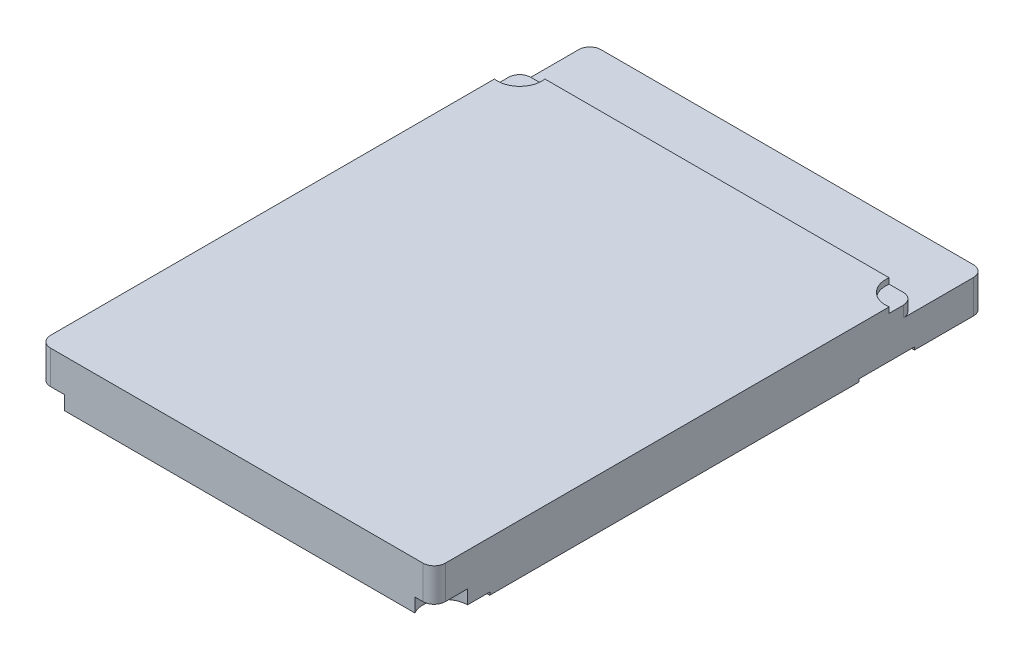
ISO-10303-21;
HEADER;
FILE_DESCRIPTION(('STEP AP214'),'2;1');
FILE_NAME('part.step','',(''),(''),'','','');
FILE_SCHEMA(('AUTOMOTIVE_DESIGN { 1 0 10303 214 1 1 1 1 }'));
ENDSEC;
DATA;
#1=APPLICATION_CONTEXT('core data for automotive mechanical design processes');
#2=APPLICATION_PROTOCOL_DEFINITION('international standard','automotive_design',2000,#1);
#3=PRODUCT_CONTEXT('',#1,'mechanical');
#4=PRODUCT('Part','Part','',(#3));
#5=PRODUCT_RELATED_PRODUCT_CATEGORY('part','',(#4));
#6=PRODUCT_DEFINITION_FORMATION('','',#4);
#7=PRODUCT_DEFINITION_CONTEXT('part definition',#1,'design');
#8=PRODUCT_DEFINITION('design','',#6,#7);
#9=PRODUCT_DEFINITION_SHAPE('','',#8);
#10=(LENGTH_UNIT() NAMED_UNIT(*) SI_UNIT(.MILLI.,.METRE.));
#11=(NAMED_UNIT(*) PLANE_ANGLE_UNIT() SI_UNIT($,.RADIAN.));
#12=(NAMED_UNIT(*) SI_UNIT($,.STERADIAN.) SOLID_ANGLE_UNIT());
#13=UNCERTAINTY_MEASURE_WITH_UNIT(LENGTH_MEASURE(1.E-05),#10,'distance_accuracy_value','');
#14=(GEOMETRIC_REPRESENTATION_CONTEXT(3) GLOBAL_UNCERTAINTY_ASSIGNED_CONTEXT((#13)) GLOBAL_UNIT_ASSIGNED_CONTEXT((#10,
#11,#12)) REPRESENTATION_CONTEXT('',''));
#15=CARTESIAN_POINT('',(0.,0.,0.));
#16=DIRECTION('',(0.,0.,1.));
#17=DIRECTION('',(1.,0.,0.));
#18=AXIS2_PLACEMENT_3D('',#15,#16,#17);
#19=CARTESIAN_POINT('',(19.2099650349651,-16.6076923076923,99.));
#20=DIRECTION('',(0.,1.,0.));
#21=DIRECTION('',(0.,0.,1.));
#22=AXIS2_PLACEMENT_3D('',#19,#20,#21);
#23=PLANE('',#22);
#24=DIRECTION('',(0.,0.,-1.));
#25=VECTOR('',#24,1.);
#26=CARTESIAN_POINT('',(90.2099650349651,-16.6076923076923,99.));
#27=LINE('',#26,#25);
#28=CARTESIAN_POINT('',(90.2099650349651,-16.6076923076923,12.6188488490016));
#29=VERTEX_POINT('',#28);
#30=CARTESIAN_POINT('',(90.2099650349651,-16.6076923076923,2.));
#31=VERTEX_POINT('',#30);
#32=EDGE_CURVE('E325',#29,#31,#27,.T.);
#33=ORIENTED_EDGE('',*,*,#32,.F.);
#34=DIRECTION('',(-1.,0.,0.));
#35=VECTOR('',#34,1.);
#36=CARTESIAN_POINT('',(19.2099650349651,-16.6076923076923,12.6188488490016));
#37=LINE('',#36,#35);
#38=CARTESIAN_POINT('',(19.2099650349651,-16.6076923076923,12.6188488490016));
#39=VERTEX_POINT('',#38);
#40=EDGE_CURVE('E251',#29,#39,#37,.T.);
#41=ORIENTED_EDGE('',*,*,#40,.T.);
#42=DIRECTION('',(0.,0.,-1.));
#43=VECTOR('',#42,1.);
#44=CARTESIAN_POINT('',(19.2099650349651,-16.6076923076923,99.));
#45=LINE('',#44,#43);
#46=CARTESIAN_POINT('',(19.2099650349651,-16.6076923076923,2.));
#47=VERTEX_POINT('',#46);
#48=EDGE_CURVE('E328',#39,#47,#45,.T.);
#49=ORIENTED_EDGE('',*,*,#48,.T.);
#50=CARTESIAN_POINT('',(21.2099650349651,-16.6076923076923,2.));
#51=DIRECTION('',(0.,1.,0.));
#52=DIRECTION('',(0.,0.,1.));
#53=AXIS2_PLACEMENT_3D('',#50,#51,#52);
#54=CIRCLE('',#53,2.);
#55=CARTESIAN_POINT('',(21.2099650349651,-16.6076923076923,0.));
#56=VERTEX_POINT('',#55);
#57=EDGE_CURVE('E345',#47,#56,#54,.F.);
#58=ORIENTED_EDGE('',*,*,#57,.T.);
#59=DIRECTION('',(1.,0.,0.));
#60=VECTOR('',#59,1.);
#61=CARTESIAN_POINT('',(19.2099650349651,-16.6076923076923,0.));
#62=LINE('',#61,#60);
#63=CARTESIAN_POINT('',(88.2099650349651,-16.6076923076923,0.));
#64=VERTEX_POINT('',#63);
#65=EDGE_CURVE('E311',#56,#64,#62,.T.);
#66=ORIENTED_EDGE('',*,*,#65,.T.);
#67=CARTESIAN_POINT('',(88.2099650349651,-16.6076923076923,2.));
#68=DIRECTION('',(0.,1.,0.));
#69=DIRECTION('',(0.,0.,1.));
#70=AXIS2_PLACEMENT_3D('',#67,#68,#69);
#71=CIRCLE('',#70,2.);
#72=EDGE_CURVE('E347',#64,#31,#71,.F.);
#73=ORIENTED_EDGE('',*,*,#72,.T.);
#74=EDGE_LOOP('',(#33,#41,#49,#58,#66,#73));
#75=FACE_BOUND('',#74,.T.);
#76=ADVANCED_FACE('F31',(#75),#23,.F.);
#77=CARTESIAN_POINT('',(88.2099650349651,-7.60769230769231,14.6188488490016));
#78=DIRECTION('',(0.,1.,0.));
#79=DIRECTION('',(0.,0.,1.));
#80=AXIS2_PLACEMENT_3D('',#77,#78,#79);
#81=CYLINDRICAL_SURFACE('',#80,2.);
#82=DIRECTION('',(0.,1.,0.));
#83=VECTOR('',#82,1.);
#84=CARTESIAN_POINT('',(88.2099650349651,-10.6076923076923,12.6188488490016));
#85=LINE('',#84,#83);
#86=CARTESIAN_POINT('',(88.2099650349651,-8.60769230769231,12.6188488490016));
#87=VERTEX_POINT('',#86);
#88=CARTESIAN_POINT('',(88.2099650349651,-10.6076923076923,12.6188488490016));
#89=VERTEX_POINT('',#88);
#90=EDGE_CURVE('E358',#87,#89,#85,.F.);
#91=ORIENTED_EDGE('',*,*,#90,.F.);
#92=CARTESIAN_POINT('',(88.2099650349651,-8.60769230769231,14.6188488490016));
#93=DIRECTION('',(0.,1.,0.));
#94=DIRECTION('',(0.,0.,1.));
#95=AXIS2_PLACEMENT_3D('',#92,#93,#94);
#96=CIRCLE('',#95,2.);
#97=CARTESIAN_POINT('',(90.2099650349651,-8.60769230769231,14.6188488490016));
#98=VERTEX_POINT('',#97);
#99=EDGE_CURVE('E396',#87,#98,#96,.F.);
#100=ORIENTED_EDGE('',*,*,#99,.T.);
#101=DIRECTION('',(0.,1.,0.));
#102=VECTOR('',#101,1.);
#103=CARTESIAN_POINT('',(90.2099650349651,-7.60769230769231,14.6188488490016));
#104=LINE('',#103,#102);
#105=CARTESIAN_POINT('',(90.2099650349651,-10.6076923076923,14.6188488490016));
#106=VERTEX_POINT('',#105);
#107=EDGE_CURVE('E331',#106,#98,#104,.T.);
#108=ORIENTED_EDGE('',*,*,#107,.F.);
#109=CARTESIAN_POINT('',(88.2099650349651,-10.6076923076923,14.6188488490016));
#110=DIRECTION('',(0.,1.,0.));
#111=DIRECTION('',(0.,0.,1.));
#112=AXIS2_PLACEMENT_3D('',#109,#110,#111);
#113=CIRCLE('',#112,2.);
#114=EDGE_CURVE('E360',#89,#106,#113,.F.);
#115=ORIENTED_EDGE('',*,*,#114,.F.);
#116=EDGE_LOOP('',(#91,#100,#108,#115));
#117=FACE_BOUND('',#116,.T.);
#118=ADVANCED_FACE('F433',(#117),#81,.T.);
#119=CARTESIAN_POINT('',(21.2099650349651,-10.6076923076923,14.6188488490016));
#120=DIRECTION('',(0.,1.,0.));
#121=DIRECTION('',(0.,0.,1.));
#122=AXIS2_PLACEMENT_3D('',#119,#120,#121);
#123=CYLINDRICAL_SURFACE('',#122,2.);
#124=DIRECTION('',(0.,1.,0.));
#125=VECTOR('',#124,1.);
#126=CARTESIAN_POINT('',(19.2099650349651,-7.60769230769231,14.6188488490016));
#127=LINE('',#126,#125);
#128=CARTESIAN_POINT('',(19.2099650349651,-8.60769230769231,14.6188488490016));
#129=VERTEX_POINT('',#128);
#130=CARTESIAN_POINT('',(19.2099650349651,-10.6076923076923,14.6188488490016));
#131=VERTEX_POINT('',#130);
#132=EDGE_CURVE('E350',#129,#131,#127,.F.);
#133=ORIENTED_EDGE('',*,*,#132,.F.);
#134=CARTESIAN_POINT('',(21.2099650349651,-8.60769230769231,14.6188488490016));
#135=DIRECTION('',(0.,1.,0.));
#136=DIRECTION('',(0.,0.,1.));
#137=AXIS2_PLACEMENT_3D('',#134,#135,#136);
#138=CIRCLE('',#137,2.);
#139=CARTESIAN_POINT('',(21.2099650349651,-8.60769230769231,12.6188488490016));
#140=VERTEX_POINT('',#139);
#141=EDGE_CURVE('E390',#129,#140,#138,.F.);
#142=ORIENTED_EDGE('',*,*,#141,.T.);
#143=DIRECTION('',(0.,1.,0.));
#144=VECTOR('',#143,1.);
#145=CARTESIAN_POINT('',(21.2099650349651,-10.6076923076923,12.6188488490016));
#146=LINE('',#145,#144);
#147=CARTESIAN_POINT('',(21.2099650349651,-10.6076923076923,12.6188488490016));
#148=VERTEX_POINT('',#147);
#149=EDGE_CURVE('E355',#148,#140,#146,.T.);
#150=ORIENTED_EDGE('',*,*,#149,.F.);
#151=CARTESIAN_POINT('',(21.2099650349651,-10.6076923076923,14.6188488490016));
#152=DIRECTION('',(0.,1.,0.));
#153=DIRECTION('',(0.,0.,1.));
#154=AXIS2_PLACEMENT_3D('',#151,#152,#153);
#155=CIRCLE('',#154,2.);
#156=EDGE_CURVE('E363',#131,#148,#155,.F.);
#157=ORIENTED_EDGE('',*,*,#156,.F.);
#158=EDGE_LOOP('',(#133,#142,#150,#157));
#159=FACE_BOUND('',#158,.T.);
#160=ADVANCED_FACE('F488',(#159),#123,.T.);
#161=CARTESIAN_POINT('',(88.2099650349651,-16.6076923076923,97.));
#162=DIRECTION('',(0.,-1.,0.));
#163=DIRECTION('',(0.,0.,-1.));
#164=AXIS2_PLACEMENT_3D('',#161,#162,#163);
#165=CYLINDRICAL_SURFACE('',#164,2.);
#166=DIRECTION('',(0.,1.,0.));
#167=VECTOR('',#166,1.);
#168=CARTESIAN_POINT('',(88.2099650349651,-7.60769230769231,99.));
#169=LINE('',#168,#167);
#170=CARTESIAN_POINT('',(88.2099650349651,-13.6076923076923,99.));
#171=VERTEX_POINT('',#170);
#172=CARTESIAN_POINT('',(88.2099650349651,-7.60769230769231,99.));
#173=VERTEX_POINT('',#172);
#174=EDGE_CURVE('E368',#171,#173,#169,.T.);
#175=ORIENTED_EDGE('',*,*,#174,.F.);
#176=CARTESIAN_POINT('',(88.2099650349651,-13.6076923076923,97.));
#177=DIRECTION('',(0.,-1.,0.));
#178=DIRECTION('',(0.,0.,-1.));
#179=AXIS2_PLACEMENT_3D('',#176,#177,#178);
#180=CIRCLE('',#179,2.);
#181=CARTESIAN_POINT('',(90.2099650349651,-13.6076923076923,97.));
#182=VERTEX_POINT('',#181);
#183=EDGE_CURVE('E384',#171,#182,#180,.F.);
#184=ORIENTED_EDGE('',*,*,#183,.T.);
#185=DIRECTION('',(0.,1.,0.));
#186=VECTOR('',#185,1.);
#187=CARTESIAN_POINT('',(90.2099650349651,-16.6076923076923,97.));
#188=LINE('',#187,#186);
#189=CARTESIAN_POINT('',(90.2099650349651,-7.60769230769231,97.));
#190=VERTEX_POINT('',#189);
#191=EDGE_CURVE('E374',#190,#182,#188,.F.);
#192=ORIENTED_EDGE('',*,*,#191,.F.);
#193=CARTESIAN_POINT('',(88.2099650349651,-7.60769230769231,97.));
#194=DIRECTION('',(0.,-1.,0.));
#195=DIRECTION('',(0.,0.,-1.));
#196=AXIS2_PLACEMENT_3D('',#193,#194,#195);
#197=CIRCLE('',#196,2.);
#198=EDGE_CURVE('E372',#173,#190,#197,.F.);
#199=ORIENTED_EDGE('',*,*,#198,.F.);
#200=EDGE_LOOP('',(#175,#184,#192,#199));
#201=FACE_BOUND('',#200,.T.);
#202=ADVANCED_FACE('F456',(#201),#165,.T.);
#203=CARTESIAN_POINT('',(21.2099650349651,-16.6076923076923,97.));
#204=DIRECTION('',(0.,1.,0.));
#205=DIRECTION('',(0.,0.,1.));
#206=AXIS2_PLACEMENT_3D('',#203,#204,#205);
#207=CYLINDRICAL_SURFACE('',#206,2.);
#208=DIRECTION('',(0.,-1.,0.));
#209=VECTOR('',#208,1.);
#210=CARTESIAN_POINT('',(19.2099650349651,-7.60769230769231,97.));
#211=LINE('',#210,#209);
#212=CARTESIAN_POINT('',(19.2099650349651,-13.6076923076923,97.));
#213=VERTEX_POINT('',#212);
#214=CARTESIAN_POINT('',(19.2099650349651,-7.60769230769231,97.));
#215=VERTEX_POINT('',#214);
#216=EDGE_CURVE('E377',#213,#215,#211,.F.);
#217=ORIENTED_EDGE('',*,*,#216,.F.);
#218=CARTESIAN_POINT('',(21.2099650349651,-13.6076923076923,97.));
#219=DIRECTION('',(0.,-1.,0.));
#220=DIRECTION('',(0.,0.,-1.));
#221=AXIS2_PLACEMENT_3D('',#218,#219,#220);
#222=CIRCLE('',#221,2.);
#223=CARTESIAN_POINT('',(21.2099650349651,-13.6076923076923,99.));
#224=VERTEX_POINT('',#223);
#225=EDGE_CURVE('E379',#213,#224,#222,.F.);
#226=ORIENTED_EDGE('',*,*,#225,.T.);
#227=DIRECTION('',(0.,-1.,0.));
#228=VECTOR('',#227,1.);
#229=CARTESIAN_POINT('',(21.2099650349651,-16.6076923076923,99.));
#230=LINE('',#229,#228);
#231=CARTESIAN_POINT('',(21.2099650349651,-7.60769230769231,99.));
#232=VERTEX_POINT('',#231);
#233=EDGE_CURVE('E365',#232,#224,#230,.T.);
#234=ORIENTED_EDGE('',*,*,#233,.F.);
#235=CARTESIAN_POINT('',(21.2099650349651,-7.60769230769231,97.));
#236=DIRECTION('',(0.,-1.,0.));
#237=DIRECTION('',(0.,0.,-1.));
#238=AXIS2_PLACEMENT_3D('',#235,#236,#237);
#239=CIRCLE('',#238,2.);
#240=EDGE_CURVE('E370',#215,#232,#239,.F.);
#241=ORIENTED_EDGE('',*,*,#240,.F.);
#242=EDGE_LOOP('',(#217,#226,#234,#241));
#243=FACE_BOUND('',#242,.T.);
#244=ADVANCED_FACE('F33',(#243),#207,.T.);
#245=CARTESIAN_POINT('',(19.2099650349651,-16.6076923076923,0.));
#246=DIRECTION('',(0.,0.,1.));
#247=DIRECTION('',(1.,0.,0.));
#248=AXIS2_PLACEMENT_3D('',#245,#246,#247);
#249=PLANE('',#248);
#250=DIRECTION('',(-1.,0.,0.));
#251=VECTOR('',#250,1.);
#252=CARTESIAN_POINT('',(90.2099650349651,-10.6076923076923,0.));
#253=LINE('',#252,#251);
#254=CARTESIAN_POINT('',(88.2099650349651,-10.6076923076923,0.));
#255=VERTEX_POINT('',#254);
#256=CARTESIAN_POINT('',(21.2099650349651,-10.6076923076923,0.));
#257=VERTEX_POINT('',#256);
#258=EDGE_CURVE('E308',#255,#257,#253,.T.);
#259=ORIENTED_EDGE('',*,*,#258,.F.);
#260=DIRECTION('',(0.,1.,0.));
#261=VECTOR('',#260,1.);
#262=CARTESIAN_POINT('',(88.2099650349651,-16.6076923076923,0.));
#263=LINE('',#262,#261);
#264=EDGE_CURVE('E343',#255,#64,#263,.F.);
#265=ORIENTED_EDGE('',*,*,#264,.T.);
#266=ORIENTED_EDGE('',*,*,#65,.F.);
#267=DIRECTION('',(0.,-1.,0.));
#268=VECTOR('',#267,1.);
#269=CARTESIAN_POINT('',(21.2099650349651,-16.6076923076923,0.));
#270=LINE('',#269,#268);
#271=EDGE_CURVE('E341',#56,#257,#270,.F.);
#272=ORIENTED_EDGE('',*,*,#271,.T.);
#273=EDGE_LOOP('',(#259,#265,#266,#272));
#274=FACE_BOUND('',#273,.T.);
#275=ADVANCED_FACE('F497',(#274),#249,.F.);
#276=CARTESIAN_POINT('',(19.2099650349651,-7.60769230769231,99.));
#277=DIRECTION('',(1.,0.,0.));
#278=DIRECTION('',(0.,0.,-1.));
#279=AXIS2_PLACEMENT_3D('',#276,#277,#278);
#280=PLANE('',#279);
#281=CARTESIAN_POINT('',(19.2099650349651,-16.6076923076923,89.));
#282=VERTEX_POINT('',#281);
#283=CARTESIAN_POINT('',(19.2099650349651,-16.6076923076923,22.6188488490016));
#284=VERTEX_POINT('',#283);
#285=EDGE_CURVE('E329',#282,#284,#45,.T.);
#286=ORIENTED_EDGE('',*,*,#285,.F.);
#287=DIRECTION('',(0.,-1.,0.));
#288=VECTOR('',#287,1.);
#289=CARTESIAN_POINT('',(19.2099650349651,-16.1076923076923,89.));
#290=LINE('',#289,#288);
#291=CARTESIAN_POINT('',(19.2099650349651,-16.1076923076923,89.));
#292=VERTEX_POINT('',#291);
#293=EDGE_CURVE('E224',#292,#282,#290,.T.);
#294=ORIENTED_EDGE('',*,*,#293,.F.);
#295=DIRECTION('',(0.,0.,-1.));
#296=VECTOR('',#295,1.);
#297=CARTESIAN_POINT('',(19.2099650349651,-16.1076923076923,99.));
#298=LINE('',#297,#296);
#299=CARTESIAN_POINT('',(19.2099650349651,-16.1076923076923,94.4573392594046));
#300=VERTEX_POINT('',#299);
#301=EDGE_CURVE('E206',#300,#292,#298,.T.);
#302=ORIENTED_EDGE('',*,*,#301,.F.);
#303=DIRECTION('',(0.,-1.,0.));
#304=VECTOR('',#303,1.);
#305=CARTESIAN_POINT('',(19.2099650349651,-13.6076923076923,94.4573392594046));
#306=LINE('',#305,#304);
#307=CARTESIAN_POINT('',(19.2099650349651,-13.6076923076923,94.4573392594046));
#308=VERTEX_POINT('',#307);
#309=EDGE_CURVE('E296',#300,#308,#306,.F.);
#310=ORIENTED_EDGE('',*,*,#309,.T.);
#311=DIRECTION('',(0.,0.,-1.));
#312=VECTOR('',#311,1.);
#313=CARTESIAN_POINT('',(19.2099650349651,-13.6076923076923,99.));
#314=LINE('',#313,#312);
#315=EDGE_CURVE('E293',#213,#308,#314,.T.);
#316=ORIENTED_EDGE('',*,*,#315,.F.);
#317=ORIENTED_EDGE('',*,*,#216,.T.);
#318=DIRECTION('',(0.,0.,-1.));
#319=VECTOR('',#318,1.);
#320=CARTESIAN_POINT('',(19.2099650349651,-7.60769230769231,99.));
#321=LINE('',#320,#319);
#322=CARTESIAN_POINT('',(19.2099650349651,-7.60769230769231,17.161509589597));
#323=VERTEX_POINT('',#322);
#324=EDGE_CURVE('E317',#215,#323,#321,.T.);
#325=ORIENTED_EDGE('',*,*,#324,.T.);
#326=DIRECTION('',(0.,1.,0.));
#327=VECTOR('',#326,1.);
#328=CARTESIAN_POINT('',(19.2099650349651,-8.60769230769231,17.161509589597));
#329=LINE('',#328,#327);
#330=CARTESIAN_POINT('',(19.2099650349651,-8.60769230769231,17.161509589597));
#331=VERTEX_POINT('',#330);
#332=EDGE_CURVE('E275',#323,#331,#329,.F.);
#333=ORIENTED_EDGE('',*,*,#332,.T.);
#334=DIRECTION('',(0.,0.,1.));
#335=VECTOR('',#334,1.);
#336=CARTESIAN_POINT('',(19.2099650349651,-8.60769230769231,99.));
#337=LINE('',#336,#335);
#338=EDGE_CURVE('E273',#129,#331,#337,.T.);
#339=ORIENTED_EDGE('',*,*,#338,.F.);
#340=ORIENTED_EDGE('',*,*,#132,.T.);
#341=DIRECTION('',(0.,0.,1.));
#342=VECTOR('',#341,1.);
#343=CARTESIAN_POINT('',(19.2099650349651,-10.6076923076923,12.6188488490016));
#344=LINE('',#343,#342);
#345=CARTESIAN_POINT('',(19.2099650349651,-10.6076923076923,2.00000000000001));
#346=VERTEX_POINT('',#345);
#347=EDGE_CURVE('E299',#346,#131,#344,.T.);
#348=ORIENTED_EDGE('',*,*,#347,.F.);
#349=DIRECTION('',(0.,-1.,0.));
#350=VECTOR('',#349,1.);
#351=CARTESIAN_POINT('',(19.2099650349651,-7.60769230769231,2.));
#352=LINE('',#351,#350);
#353=EDGE_CURVE('E352',#346,#47,#352,.T.);
#354=ORIENTED_EDGE('',*,*,#353,.T.);
#355=ORIENTED_EDGE('',*,*,#48,.F.);
#356=DIRECTION('',(0.,-1.,0.));
#357=VECTOR('',#356,1.);
#358=CARTESIAN_POINT('',(19.2099650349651,-17.6646277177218,12.6188488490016));
#359=LINE('',#358,#357);
#360=CARTESIAN_POINT('',(19.2099650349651,-16.1076923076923,12.6188488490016));
#361=VERTEX_POINT('',#360);
#362=EDGE_CURVE('E233',#361,#39,#359,.T.);
#363=ORIENTED_EDGE('',*,*,#362,.F.);
#364=DIRECTION('',(0.,0.,-1.));
#365=VECTOR('',#364,1.);
#366=CARTESIAN_POINT('',(19.2099650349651,-16.1076923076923,12.6188488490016));
#367=LINE('',#366,#365);
#368=CARTESIAN_POINT('',(19.2099650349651,-16.1076923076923,22.6188488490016));
#369=VERTEX_POINT('',#368);
#370=EDGE_CURVE('E237',#369,#361,#367,.T.);
#371=ORIENTED_EDGE('',*,*,#370,.F.);
#372=DIRECTION('',(0.,1.,0.));
#373=VECTOR('',#372,1.);
#374=CARTESIAN_POINT('',(19.2099650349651,-17.6646277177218,22.6188488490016));
#375=LINE('',#374,#373);
#376=EDGE_CURVE('E241',#284,#369,#375,.T.);
#377=ORIENTED_EDGE('',*,*,#376,.F.);
#378=EDGE_LOOP('',(#286,#294,#302,#310,#316,#317,#325,#333,#339,#340,#348,#354,#355,#363,#371,#377));
#379=FACE_BOUND('',#378,.T.);
#380=ADVANCED_FACE('F411',(#379),#280,.F.);
#381=CARTESIAN_POINT('',(90.2099650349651,-16.6076923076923,89.));
#382=VERTEX_POINT('',#381);
#383=CARTESIAN_POINT('',(90.2099650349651,-16.6076923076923,22.6188488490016));
#384=VERTEX_POINT('',#383);
#385=EDGE_CURVE('E326',#382,#384,#27,.T.);
#386=ORIENTED_EDGE('',*,*,#385,.F.);
#387=DIRECTION('',(-1.,0.,0.));
#388=VECTOR('',#387,1.);
#389=CARTESIAN_POINT('',(19.2099650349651,-16.6076923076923,89.));
#390=LINE('',#389,#388);
#391=EDGE_CURVE('E216',#382,#282,#390,.T.);
#392=ORIENTED_EDGE('',*,*,#391,.T.);
#393=ORIENTED_EDGE('',*,*,#285,.T.);
#394=DIRECTION('',(1.,0.,0.));
#395=VECTOR('',#394,1.);
#396=CARTESIAN_POINT('',(19.2099650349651,-16.6076923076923,22.6188488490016));
#397=LINE('',#396,#395);
#398=EDGE_CURVE('E247',#284,#384,#397,.T.);
#399=ORIENTED_EDGE('',*,*,#398,.T.);
#400=EDGE_LOOP('',(#386,#392,#393,#399));
#401=FACE_BOUND('',#400,.T.);
#402=ADVANCED_FACE('F408',(#401),#23,.F.);
#403=CARTESIAN_POINT('',(90.2099650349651,-7.60769230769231,99.));
#404=DIRECTION('',(-1.,0.,0.));
#405=DIRECTION('',(0.,0.,1.));
#406=AXIS2_PLACEMENT_3D('',#403,#404,#405);
#407=PLANE('',#406);
#408=DIRECTION('',(0.,0.,-1.));
#409=VECTOR('',#408,1.);
#410=CARTESIAN_POINT('',(90.2099650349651,-16.1076923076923,99.));
#411=LINE('',#410,#409);
#412=CARTESIAN_POINT('',(90.2099650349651,-16.1076923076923,93.));
#413=VERTEX_POINT('',#412);
#414=CARTESIAN_POINT('',(90.2099650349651,-16.1076923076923,89.));
#415=VERTEX_POINT('',#414);
#416=EDGE_CURVE('E46',#413,#415,#411,.T.);
#417=ORIENTED_EDGE('',*,*,#416,.T.);
#418=DIRECTION('',(0.,-1.,0.));
#419=VECTOR('',#418,1.);
#420=CARTESIAN_POINT('',(90.2099650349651,-16.1076923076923,89.));
#421=LINE('',#420,#419);
#422=EDGE_CURVE('E213',#415,#382,#421,.T.);
#423=ORIENTED_EDGE('',*,*,#422,.T.);
#424=ORIENTED_EDGE('',*,*,#385,.T.);
#425=DIRECTION('',(0.,1.,0.));
#426=VECTOR('',#425,1.);
#427=CARTESIAN_POINT('',(90.2099650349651,-7.60769230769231,22.6188488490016));
#428=LINE('',#427,#426);
#429=CARTESIAN_POINT('',(90.2099650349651,-16.1076923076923,22.6188488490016));
#430=VERTEX_POINT('',#429);
#431=EDGE_CURVE('E39',#384,#430,#428,.T.);
#432=ORIENTED_EDGE('',*,*,#431,.T.);
#433=DIRECTION('',(0.,0.,-1.));
#434=VECTOR('',#433,1.);
#435=CARTESIAN_POINT('',(90.2099650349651,-16.1076923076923,12.6188488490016));
#436=LINE('',#435,#434);
#437=CARTESIAN_POINT('',(90.2099650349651,-16.1076923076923,12.6188488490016));
#438=VERTEX_POINT('',#437);
#439=EDGE_CURVE('E53',#430,#438,#436,.T.);
#440=ORIENTED_EDGE('',*,*,#439,.T.);
#441=DIRECTION('',(0.,-1.,0.));
#442=VECTOR('',#441,1.);
#443=CARTESIAN_POINT('',(90.2099650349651,-17.6646277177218,12.6188488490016));
#444=LINE('',#443,#442);
#445=EDGE_CURVE('E234',#438,#29,#444,.T.);
#446=ORIENTED_EDGE('',*,*,#445,.T.);
#447=ORIENTED_EDGE('',*,*,#32,.T.);
#448=DIRECTION('',(0.,1.,0.));
#449=VECTOR('',#448,1.);
#450=CARTESIAN_POINT('',(90.2099650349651,-7.60769230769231,2.));
#451=LINE('',#450,#449);
#452=CARTESIAN_POINT('',(90.2099650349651,-10.6076923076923,2.));
#453=VERTEX_POINT('',#452);
#454=EDGE_CURVE('E334',#31,#453,#451,.T.);
#455=ORIENTED_EDGE('',*,*,#454,.T.);
#456=DIRECTION('',(0.,0.,-1.));
#457=VECTOR('',#456,1.);
#458=CARTESIAN_POINT('',(90.2099650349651,-10.6076923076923,12.6188488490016));
#459=LINE('',#458,#457);
#460=EDGE_CURVE('E305',#106,#453,#459,.T.);
#461=ORIENTED_EDGE('',*,*,#460,.F.);
#462=ORIENTED_EDGE('',*,*,#107,.T.);
#463=DIRECTION('',(0.,0.,-1.));
#464=VECTOR('',#463,1.);
#465=CARTESIAN_POINT('',(90.2099650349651,-8.60769230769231,99.));
#466=LINE('',#465,#464);
#467=CARTESIAN_POINT('',(90.2099650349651,-8.60769230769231,17.161509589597));
#468=VERTEX_POINT('',#467);
#469=EDGE_CURVE('E261',#468,#98,#466,.T.);
#470=ORIENTED_EDGE('',*,*,#469,.F.);
#471=DIRECTION('',(0.,1.,0.));
#472=VECTOR('',#471,1.);
#473=CARTESIAN_POINT('',(90.2099650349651,-8.60769230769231,17.161509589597));
#474=LINE('',#473,#472);
#475=CARTESIAN_POINT('',(90.2099650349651,-7.60769230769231,17.161509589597));
#476=VERTEX_POINT('',#475);
#477=EDGE_CURVE('E263',#468,#476,#474,.T.);
#478=ORIENTED_EDGE('',*,*,#477,.T.);
#479=DIRECTION('',(0.,0.,-1.));
#480=VECTOR('',#479,1.);
#481=CARTESIAN_POINT('',(90.2099650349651,-7.60769230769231,99.));
#482=LINE('',#481,#480);
#483=EDGE_CURVE('E322',#190,#476,#482,.T.);
#484=ORIENTED_EDGE('',*,*,#483,.F.);
#485=ORIENTED_EDGE('',*,*,#191,.T.);
#486=DIRECTION('',(0.,0.,1.));
#487=VECTOR('',#486,1.);
#488=CARTESIAN_POINT('',(90.2099650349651,-13.6076923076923,99.));
#489=LINE('',#488,#487);
#490=CARTESIAN_POINT('',(90.2099650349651,-13.6076923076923,93.));
#491=VERTEX_POINT('',#490);
#492=EDGE_CURVE('E284',#491,#182,#489,.T.);
#493=ORIENTED_EDGE('',*,*,#492,.F.);
#494=DIRECTION('',(0.,-1.,0.));
#495=VECTOR('',#494,1.);
#496=CARTESIAN_POINT('',(90.2099650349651,-13.6076923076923,93.));
#497=LINE('',#496,#495);
#498=EDGE_CURVE('E223',#491,#413,#497,.T.);
#499=ORIENTED_EDGE('',*,*,#498,.T.);
#500=EDGE_LOOP('',(#417,#423,#424,#432,#440,#446,#447,#455,#461,#462,#470,#478,#484,#485,#493,#499));
#501=FACE_BOUND('',#500,.T.);
#502=ADVANCED_FACE('F221',(#501),#407,.F.);
#503=CARTESIAN_POINT('',(19.2099650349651,-7.60769230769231,99.));
#504=DIRECTION('',(0.,-1.,0.));
#505=DIRECTION('',(0.,0.,-1.));
#506=AXIS2_PLACEMENT_3D('',#503,#504,#505);
#507=PLANE('',#506);
#508=ORIENTED_EDGE('',*,*,#483,.T.);
#509=CARTESIAN_POINT('',(89.6241785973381,-7.60769230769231,13.2046352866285));
#510=DIRECTION('',(0.,1.,0.));
#511=DIRECTION('',(0.,0.,1.));
#512=AXIS2_PLACEMENT_3D('',#509,#510,#511);
#513=CIRCLE('',#512,4.00000000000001);
#514=CARTESIAN_POINT('',(85.6673042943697,-7.60769230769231,12.6188488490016));
#515=VERTEX_POINT('',#514);
#516=EDGE_CURVE('E254',#515,#476,#513,.T.);
#517=ORIENTED_EDGE('',*,*,#516,.F.);
#518=DIRECTION('',(1.,0.,0.));
#519=VECTOR('',#518,1.);
#520=CARTESIAN_POINT('',(90.2099650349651,-7.60769230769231,12.6188488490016));
#521=LINE('',#520,#519);
#522=CARTESIAN_POINT('',(23.7526257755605,-7.60769230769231,12.6188488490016));
#523=VERTEX_POINT('',#522);
#524=EDGE_CURVE('E298',#523,#515,#521,.T.);
#525=ORIENTED_EDGE('',*,*,#524,.F.);
#526=CARTESIAN_POINT('',(19.795751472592,-7.60769230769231,13.2046352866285));
#527=DIRECTION('',(0.,1.,0.));
#528=DIRECTION('',(0.,0.,1.));
#529=AXIS2_PLACEMENT_3D('',#526,#527,#528);
#530=CIRCLE('',#529,4.);
#531=EDGE_CURVE('E266',#323,#523,#530,.T.);
#532=ORIENTED_EDGE('',*,*,#531,.F.);
#533=ORIENTED_EDGE('',*,*,#324,.F.);
#534=ORIENTED_EDGE('',*,*,#240,.T.);
#535=DIRECTION('',(-1.,0.,0.));
#536=VECTOR('',#535,1.);
#537=CARTESIAN_POINT('',(19.2099650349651,-7.60769230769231,99.));
#538=LINE('',#537,#536);
#539=EDGE_CURVE('E314',#173,#232,#538,.T.);
#540=ORIENTED_EDGE('',*,*,#539,.F.);
#541=ORIENTED_EDGE('',*,*,#198,.T.);
#542=EDGE_LOOP('',(#508,#517,#525,#532,#533,#534,#540,#541));
#543=FACE_BOUND('',#542,.T.);
#544=ADVANCED_FACE('F449',(#543),#507,.F.);
#545=CARTESIAN_POINT('',(19.2099650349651,-16.6076923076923,99.));
#546=DIRECTION('',(0.,0.,1.));
#547=DIRECTION('',(1.,0.,0.));
#548=AXIS2_PLACEMENT_3D('',#545,#546,#547);
#549=PLANE('',#548);
#550=DIRECTION('',(-1.,0.,0.));
#551=VECTOR('',#550,1.);
#552=CARTESIAN_POINT('',(90.2099650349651,-16.1076923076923,99.));
#553=LINE('',#552,#551);
#554=CARTESIAN_POINT('',(86.7458634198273,-16.1076923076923,99.));
#555=VERTEX_POINT('',#554);
#556=CARTESIAN_POINT('',(23.7526257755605,-16.1076923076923,99.));
#557=VERTEX_POINT('',#556);
#558=EDGE_CURVE('E210',#555,#557,#553,.T.);
#559=ORIENTED_EDGE('',*,*,#558,.F.);
#560=DIRECTION('',(0.,-1.,0.));
#561=VECTOR('',#560,1.);
#562=CARTESIAN_POINT('',(86.7458634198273,-13.6076923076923,99.));
#563=LINE('',#562,#561);
#564=CARTESIAN_POINT('',(86.7458634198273,-13.6076923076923,99.));
#565=VERTEX_POINT('',#564);
#566=EDGE_CURVE('E387',#565,#555,#563,.T.);
#567=ORIENTED_EDGE('',*,*,#566,.F.);
#568=DIRECTION('',(1.,0.,0.));
#569=VECTOR('',#568,1.);
#570=CARTESIAN_POINT('',(19.2099650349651,-13.6076923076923,99.));
#571=LINE('',#570,#569);
#572=EDGE_CURVE('E281',#565,#171,#571,.T.);
#573=ORIENTED_EDGE('',*,*,#572,.T.);
#574=ORIENTED_EDGE('',*,*,#174,.T.);
#575=ORIENTED_EDGE('',*,*,#539,.T.);
#576=ORIENTED_EDGE('',*,*,#233,.T.);
#577=DIRECTION('',(1.,0.,0.));
#578=VECTOR('',#577,1.);
#579=CARTESIAN_POINT('',(19.2099650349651,-13.6076923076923,99.));
#580=LINE('',#579,#578);
#581=CARTESIAN_POINT('',(23.7526257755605,-13.6076923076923,99.));
#582=VERTEX_POINT('',#581);
#583=EDGE_CURVE('E290',#224,#582,#580,.T.);
#584=ORIENTED_EDGE('',*,*,#583,.T.);
#585=DIRECTION('',(0.,-1.,0.));
#586=VECTOR('',#585,1.);
#587=CARTESIAN_POINT('',(23.7526257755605,-13.6076923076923,99.));
#588=LINE('',#587,#586);
#589=EDGE_CURVE('E382',#557,#582,#588,.F.);
#590=ORIENTED_EDGE('',*,*,#589,.F.);
#591=EDGE_LOOP('',(#559,#567,#573,#574,#575,#576,#584,#590));
#592=FACE_BOUND('',#591,.T.);
#593=ADVANCED_FACE('F463',(#592),#549,.T.);
#594=CARTESIAN_POINT('',(90.2099650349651,-10.6076923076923,12.6188488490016));
#595=DIRECTION('',(0.,0.,1.));
#596=DIRECTION('',(1.,0.,0.));
#597=AXIS2_PLACEMENT_3D('',#594,#595,#596);
#598=PLANE('',#597);
#599=ORIENTED_EDGE('',*,*,#524,.T.);
#600=DIRECTION('',(0.,1.,0.));
#601=VECTOR('',#600,1.);
#602=CARTESIAN_POINT('',(85.6673042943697,-8.60769230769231,12.6188488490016));
#603=LINE('',#602,#601);
#604=CARTESIAN_POINT('',(85.6673042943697,-8.60769230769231,12.6188488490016));
#605=VERTEX_POINT('',#604);
#606=EDGE_CURVE('E399',#515,#605,#603,.F.);
#607=ORIENTED_EDGE('',*,*,#606,.T.);
#608=DIRECTION('',(-1.,0.,0.));
#609=VECTOR('',#608,1.);
#610=CARTESIAN_POINT('',(90.2099650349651,-8.60769230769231,12.6188488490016));
#611=LINE('',#610,#609);
#612=EDGE_CURVE('E258',#87,#605,#611,.T.);
#613=ORIENTED_EDGE('',*,*,#612,.F.);
#614=ORIENTED_EDGE('',*,*,#90,.T.);
#615=DIRECTION('',(1.,0.,0.));
#616=VECTOR('',#615,1.);
#617=CARTESIAN_POINT('',(90.2099650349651,-10.6076923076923,12.6188488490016));
#618=LINE('',#617,#616);
#619=EDGE_CURVE('E302',#148,#89,#618,.T.);
#620=ORIENTED_EDGE('',*,*,#619,.F.);
#621=ORIENTED_EDGE('',*,*,#149,.T.);
#622=DIRECTION('',(-1.,0.,0.));
#623=VECTOR('',#622,1.);
#624=CARTESIAN_POINT('',(90.2099650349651,-8.60769230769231,12.6188488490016));
#625=LINE('',#624,#623);
#626=CARTESIAN_POINT('',(23.7526257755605,-8.60769230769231,12.6188488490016));
#627=VERTEX_POINT('',#626);
#628=EDGE_CURVE('E270',#627,#140,#625,.T.);
#629=ORIENTED_EDGE('',*,*,#628,.F.);
#630=DIRECTION('',(0.,1.,0.));
#631=VECTOR('',#630,1.);
#632=CARTESIAN_POINT('',(23.7526257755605,-8.60769230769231,12.6188488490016));
#633=LINE('',#632,#631);
#634=EDGE_CURVE('E393',#627,#523,#633,.T.);
#635=ORIENTED_EDGE('',*,*,#634,.T.);
#636=EDGE_LOOP('',(#599,#607,#613,#614,#620,#621,#629,#635));
#637=FACE_BOUND('',#636,.T.);
#638=ADVANCED_FACE('F444',(#637),#598,.F.);
#639=CARTESIAN_POINT('',(19.2099650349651,-10.6076923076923,0.));
#640=DIRECTION('',(0.,1.,0.));
#641=DIRECTION('',(0.,0.,1.));
#642=AXIS2_PLACEMENT_3D('',#639,#640,#641);
#643=PLANE('',#642);
#644=ORIENTED_EDGE('',*,*,#460,.T.);
#645=CARTESIAN_POINT('',(88.2099650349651,-10.6076923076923,2.));
#646=DIRECTION('',(0.,1.,0.));
#647=DIRECTION('',(0.,0.,1.));
#648=AXIS2_PLACEMENT_3D('',#645,#646,#647);
#649=CIRCLE('',#648,2.);
#650=EDGE_CURVE('E339',#453,#255,#649,.T.);
#651=ORIENTED_EDGE('',*,*,#650,.T.);
#652=ORIENTED_EDGE('',*,*,#258,.T.);
#653=CARTESIAN_POINT('',(21.2099650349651,-10.6076923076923,2.));
#654=DIRECTION('',(0.,1.,0.));
#655=DIRECTION('',(0.,0.,1.));
#656=AXIS2_PLACEMENT_3D('',#653,#654,#655);
#657=CIRCLE('',#656,2.);
#658=EDGE_CURVE('E337',#257,#346,#657,.T.);
#659=ORIENTED_EDGE('',*,*,#658,.T.);
#660=ORIENTED_EDGE('',*,*,#347,.T.);
#661=ORIENTED_EDGE('',*,*,#156,.T.);
#662=ORIENTED_EDGE('',*,*,#619,.T.);
#663=ORIENTED_EDGE('',*,*,#114,.T.);
#664=EDGE_LOOP('',(#644,#651,#652,#659,#660,#661,#662,#663));
#665=FACE_BOUND('',#664,.T.);
#666=ADVANCED_FACE('F426',(#665),#643,.T.);
#667=CARTESIAN_POINT('',(88.2099650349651,-7.60769230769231,2.));
#668=DIRECTION('',(0.,1.,0.));
#669=DIRECTION('',(0.,0.,1.));
#670=AXIS2_PLACEMENT_3D('',#667,#668,#669);
#671=CYLINDRICAL_SURFACE('',#670,2.);
#672=ORIENTED_EDGE('',*,*,#72,.F.);
#673=ORIENTED_EDGE('',*,*,#264,.F.);
#674=ORIENTED_EDGE('',*,*,#650,.F.);
#675=ORIENTED_EDGE('',*,*,#454,.F.);
#676=EDGE_LOOP('',(#672,#673,#674,#675));
#677=FACE_BOUND('',#676,.T.);
#678=ADVANCED_FACE('F499',(#677),#671,.T.);
#679=CARTESIAN_POINT('',(21.2099650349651,-7.60769230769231,2.));
#680=DIRECTION('',(0.,-1.,0.));
#681=DIRECTION('',(0.,0.,-1.));
#682=AXIS2_PLACEMENT_3D('',#679,#680,#681);
#683=CYLINDRICAL_SURFACE('',#682,2.);
#684=ORIENTED_EDGE('',*,*,#658,.F.);
#685=ORIENTED_EDGE('',*,*,#271,.F.);
#686=ORIENTED_EDGE('',*,*,#57,.F.);
#687=ORIENTED_EDGE('',*,*,#353,.F.);
#688=EDGE_LOOP('',(#684,#685,#686,#687));
#689=FACE_BOUND('',#688,.T.);
#690=ADVANCED_FACE('F494',(#689),#683,.T.);
#691=CARTESIAN_POINT('',(19.795751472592,-13.6076923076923,98.4142135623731));
#692=DIRECTION('',(0.,-1.,0.));
#693=DIRECTION('',(0.,0.,-1.));
#694=AXIS2_PLACEMENT_3D('',#691,#692,#693);
#695=CYLINDRICAL_SURFACE('',#694,4.);
#696=ORIENTED_EDGE('',*,*,#309,.F.);
#697=CARTESIAN_POINT('',(19.795751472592,-16.1076923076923,98.4142135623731));
#698=DIRECTION('',(0.,1.,0.));
#699=DIRECTION('',(0.,0.,1.));
#700=AXIS2_PLACEMENT_3D('',#697,#698,#699);
#701=CIRCLE('',#700,4.);
#702=EDGE_CURVE('E209',#300,#557,#701,.F.);
#703=ORIENTED_EDGE('',*,*,#702,.T.);
#704=ORIENTED_EDGE('',*,*,#589,.T.);
#705=CARTESIAN_POINT('',(19.795751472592,-13.6076923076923,98.4142135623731));
#706=DIRECTION('',(0.,-1.,0.));
#707=DIRECTION('',(0.,0.,-1.));
#708=AXIS2_PLACEMENT_3D('',#705,#706,#707);
#709=CIRCLE('',#708,4.);
#710=EDGE_CURVE('E287',#308,#582,#709,.T.);
#711=ORIENTED_EDGE('',*,*,#710,.F.);
#712=EDGE_LOOP('',(#696,#703,#704,#711));
#713=FACE_BOUND('',#712,.T.);
#714=ADVANCED_FACE('F469',(#713),#695,.F.);
#715=CARTESIAN_POINT('',(19.795751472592,-13.6076923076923,98.4142135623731));
#716=DIRECTION('',(0.,-1.,0.));
#717=DIRECTION('',(0.,0.,-1.));
#718=AXIS2_PLACEMENT_3D('',#715,#716,#717);
#719=PLANE('',#718);
#720=ORIENTED_EDGE('',*,*,#315,.T.);
#721=ORIENTED_EDGE('',*,*,#710,.T.);
#722=ORIENTED_EDGE('',*,*,#583,.F.);
#723=ORIENTED_EDGE('',*,*,#225,.F.);
#724=EDGE_LOOP('',(#720,#721,#722,#723));
#725=FACE_BOUND('',#724,.T.);
#726=ADVANCED_FACE('F473',(#725),#719,.T.);
#727=CARTESIAN_POINT('',(90.2099650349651,-13.6076923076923,97.));
#728=DIRECTION('',(0.,-1.,0.));
#729=DIRECTION('',(0.,0.,-1.));
#730=AXIS2_PLACEMENT_3D('',#727,#728,#729);
#731=CYLINDRICAL_SURFACE('',#730,4.00000000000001);
#732=ORIENTED_EDGE('',*,*,#566,.T.);
#733=CARTESIAN_POINT('',(90.2099650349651,-16.1076923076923,97.));
#734=DIRECTION('',(0.,1.,0.));
#735=DIRECTION('',(0.,0.,1.));
#736=AXIS2_PLACEMENT_3D('',#733,#734,#735);
#737=CIRCLE('',#736,4.00000000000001);
#738=EDGE_CURVE('E12',#555,#413,#737,.F.);
#739=ORIENTED_EDGE('',*,*,#738,.T.);
#740=ORIENTED_EDGE('',*,*,#498,.F.);
#741=CARTESIAN_POINT('',(90.2099650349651,-13.6076923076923,97.));
#742=DIRECTION('',(0.,-1.,0.));
#743=DIRECTION('',(0.,0.,-1.));
#744=AXIS2_PLACEMENT_3D('',#741,#742,#743);
#745=CIRCLE('',#744,4.00000000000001);
#746=EDGE_CURVE('E278',#565,#491,#745,.T.);
#747=ORIENTED_EDGE('',*,*,#746,.F.);
#748=EDGE_LOOP('',(#732,#739,#740,#747));
#749=FACE_BOUND('',#748,.T.);
#750=ADVANCED_FACE('F466',(#749),#731,.F.);
#751=CARTESIAN_POINT('',(90.2099650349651,-13.6076923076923,97.));
#752=DIRECTION('',(0.,-1.,0.));
#753=DIRECTION('',(0.,0.,-1.));
#754=AXIS2_PLACEMENT_3D('',#751,#752,#753);
#755=PLANE('',#754);
#756=ORIENTED_EDGE('',*,*,#492,.T.);
#757=ORIENTED_EDGE('',*,*,#183,.F.);
#758=ORIENTED_EDGE('',*,*,#572,.F.);
#759=ORIENTED_EDGE('',*,*,#746,.T.);
#760=EDGE_LOOP('',(#756,#757,#758,#759));
#761=FACE_BOUND('',#760,.T.);
#762=ADVANCED_FACE('F458',(#761),#755,.T.);
#763=CARTESIAN_POINT('',(19.795751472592,-8.60769230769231,13.2046352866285));
#764=DIRECTION('',(0.,1.,0.));
#765=DIRECTION('',(0.,0.,1.));
#766=AXIS2_PLACEMENT_3D('',#763,#764,#765);
#767=CYLINDRICAL_SURFACE('',#766,4.);
#768=ORIENTED_EDGE('',*,*,#531,.T.);
#769=ORIENTED_EDGE('',*,*,#634,.F.);
#770=CARTESIAN_POINT('',(19.795751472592,-8.60769230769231,13.2046352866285));
#771=DIRECTION('',(0.,1.,0.));
#772=DIRECTION('',(0.,0.,1.));
#773=AXIS2_PLACEMENT_3D('',#770,#771,#772);
#774=CIRCLE('',#773,4.);
#775=EDGE_CURVE('E267',#331,#627,#774,.T.);
#776=ORIENTED_EDGE('',*,*,#775,.F.);
#777=ORIENTED_EDGE('',*,*,#332,.F.);
#778=EDGE_LOOP('',(#768,#769,#776,#777));
#779=FACE_BOUND('',#778,.T.);
#780=ADVANCED_FACE('F482',(#779),#767,.F.);
#781=CARTESIAN_POINT('',(19.795751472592,-8.60769230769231,13.2046352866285));
#782=DIRECTION('',(0.,1.,0.));
#783=DIRECTION('',(0.,0.,1.));
#784=AXIS2_PLACEMENT_3D('',#781,#782,#783);
#785=PLANE('',#784);
#786=ORIENTED_EDGE('',*,*,#338,.T.);
#787=ORIENTED_EDGE('',*,*,#775,.T.);
#788=ORIENTED_EDGE('',*,*,#628,.T.);
#789=ORIENTED_EDGE('',*,*,#141,.F.);
#790=EDGE_LOOP('',(#786,#787,#788,#789));
#791=FACE_BOUND('',#790,.T.);
#792=ADVANCED_FACE('F484',(#791),#785,.T.);
#793=CARTESIAN_POINT('',(89.6241785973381,-8.60769230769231,13.2046352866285));
#794=DIRECTION('',(0.,1.,0.));
#795=DIRECTION('',(0.,0.,1.));
#796=AXIS2_PLACEMENT_3D('',#793,#794,#795);
#797=CYLINDRICAL_SURFACE('',#796,4.00000000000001);
#798=CARTESIAN_POINT('',(89.6241785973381,-8.60769230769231,13.2046352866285));
#799=DIRECTION('',(0.,1.,0.));
#800=DIRECTION('',(0.,0.,1.));
#801=AXIS2_PLACEMENT_3D('',#798,#799,#800);
#802=CIRCLE('',#801,4.00000000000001);
#803=EDGE_CURVE('E255',#605,#468,#802,.T.);
#804=ORIENTED_EDGE('',*,*,#803,.F.);
#805=ORIENTED_EDGE('',*,*,#606,.F.);
#806=ORIENTED_EDGE('',*,*,#516,.T.);
#807=ORIENTED_EDGE('',*,*,#477,.F.);
#808=EDGE_LOOP('',(#804,#805,#806,#807));
#809=FACE_BOUND('',#808,.T.);
#810=ADVANCED_FACE('F441',(#809),#797,.F.);
#811=CARTESIAN_POINT('',(89.6241785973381,-8.60769230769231,13.2046352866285));
#812=DIRECTION('',(0.,1.,0.));
#813=DIRECTION('',(0.,0.,1.));
#814=AXIS2_PLACEMENT_3D('',#811,#812,#813);
#815=PLANE('',#814);
#816=ORIENTED_EDGE('',*,*,#469,.T.);
#817=ORIENTED_EDGE('',*,*,#99,.F.);
#818=ORIENTED_EDGE('',*,*,#612,.T.);
#819=ORIENTED_EDGE('',*,*,#803,.T.);
#820=EDGE_LOOP('',(#816,#817,#818,#819));
#821=FACE_BOUND('',#820,.T.);
#822=ADVANCED_FACE('F437',(#821),#815,.T.);
#823=CARTESIAN_POINT('',(90.2099650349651,-17.6646277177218,12.6188488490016));
#824=DIRECTION('',(0.,0.,-1.));
#825=DIRECTION('',(-1.,0.,0.));
#826=AXIS2_PLACEMENT_3D('',#823,#824,#825);
#827=PLANE('',#826);
#828=ORIENTED_EDGE('',*,*,#445,.F.);
#829=DIRECTION('',(-1.,0.,0.));
#830=VECTOR('',#829,1.);
#831=CARTESIAN_POINT('',(90.2099650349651,-16.1076923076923,12.6188488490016));
#832=LINE('',#831,#830);
#833=EDGE_CURVE('E245',#438,#361,#832,.T.);
#834=ORIENTED_EDGE('',*,*,#833,.T.);
#835=ORIENTED_EDGE('',*,*,#362,.T.);
#836=ORIENTED_EDGE('',*,*,#40,.F.);
#837=EDGE_LOOP('',(#828,#834,#835,#836));
#838=FACE_BOUND('',#837,.T.);
#839=ADVANCED_FACE('F418',(#838),#827,.F.);
#840=CARTESIAN_POINT('',(90.2099650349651,-17.6646277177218,22.6188488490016));
#841=DIRECTION('',(0.,0.,1.));
#842=DIRECTION('',(1.,0.,0.));
#843=AXIS2_PLACEMENT_3D('',#840,#841,#842);
#844=PLANE('',#843);
#845=ORIENTED_EDGE('',*,*,#376,.T.);
#846=DIRECTION('',(-1.,0.,0.));
#847=VECTOR('',#846,1.);
#848=CARTESIAN_POINT('',(90.2099650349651,-16.1076923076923,22.6188488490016));
#849=LINE('',#848,#847);
#850=EDGE_CURVE('E239',#430,#369,#849,.T.);
#851=ORIENTED_EDGE('',*,*,#850,.F.);
#852=ORIENTED_EDGE('',*,*,#431,.F.);
#853=ORIENTED_EDGE('',*,*,#398,.F.);
#854=EDGE_LOOP('',(#845,#851,#852,#853));
#855=FACE_BOUND('',#854,.T.);
#856=ADVANCED_FACE('F405',(#855),#844,.F.);
#857=CARTESIAN_POINT('',(90.2099650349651,-16.1076923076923,12.6188488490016));
#858=DIRECTION('',(0.,1.,0.));
#859=DIRECTION('',(0.,0.,1.));
#860=AXIS2_PLACEMENT_3D('',#857,#858,#859);
#861=PLANE('',#860);
#862=ORIENTED_EDGE('',*,*,#370,.T.);
#863=ORIENTED_EDGE('',*,*,#833,.F.);
#864=ORIENTED_EDGE('',*,*,#439,.F.);
#865=ORIENTED_EDGE('',*,*,#850,.T.);
#866=EDGE_LOOP('',(#862,#863,#864,#865));
#867=FACE_BOUND('',#866,.T.);
#868=ADVANCED_FACE('F414',(#867),#861,.F.);
#869=CARTESIAN_POINT('',(90.2099650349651,-16.1076923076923,89.));
#870=DIRECTION('',(0.,0.,-1.));
#871=DIRECTION('',(-1.,0.,0.));
#872=AXIS2_PLACEMENT_3D('',#869,#870,#871);
#873=PLANE('',#872);
#874=ORIENTED_EDGE('',*,*,#422,.F.);
#875=DIRECTION('',(-1.,0.,0.));
#876=VECTOR('',#875,1.);
#877=CARTESIAN_POINT('',(90.2099650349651,-16.1076923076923,89.));
#878=LINE('',#877,#876);
#879=EDGE_CURVE('E202',#415,#292,#878,.T.);
#880=ORIENTED_EDGE('',*,*,#879,.T.);
#881=ORIENTED_EDGE('',*,*,#293,.T.);
#882=ORIENTED_EDGE('',*,*,#391,.F.);
#883=EDGE_LOOP('',(#874,#880,#881,#882));
#884=FACE_BOUND('',#883,.T.);
#885=ADVANCED_FACE('F214',(#884),#873,.F.);
#886=CARTESIAN_POINT('',(90.2099650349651,-16.1076923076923,99.));
#887=DIRECTION('',(0.,1.,0.));
#888=DIRECTION('',(0.,0.,1.));
#889=AXIS2_PLACEMENT_3D('',#886,#887,#888);
#890=PLANE('',#889);
#891=ORIENTED_EDGE('',*,*,#301,.T.);
#892=ORIENTED_EDGE('',*,*,#879,.F.);
#893=ORIENTED_EDGE('',*,*,#416,.F.);
#894=ORIENTED_EDGE('',*,*,#738,.F.);
#895=ORIENTED_EDGE('',*,*,#558,.T.);
#896=ORIENTED_EDGE('',*,*,#702,.F.);
#897=EDGE_LOOP('',(#891,#892,#893,#894,#895,#896));
#898=FACE_BOUND('',#897,.T.);
#899=ADVANCED_FACE('F204',(#898),#890,.F.);
#900=CLOSED_SHELL('',(#76,#118,#160,#202,#244,#275,#380,#402,#502,#544,#593,#638,#666,#678,#690,
#714,#726,#750,#762,#780,#792,#810,#822,#839,#856,#868,#885,#899));
#901=MANIFOLD_SOLID_BREP('B2',#900);
#902=ADVANCED_BREP_SHAPE_REPRESENTATION('',(#18,#901),#14);
#903=SHAPE_DEFINITION_REPRESENTATION(#9,#902);
ENDSEC;
END-ISO-10303-21;
